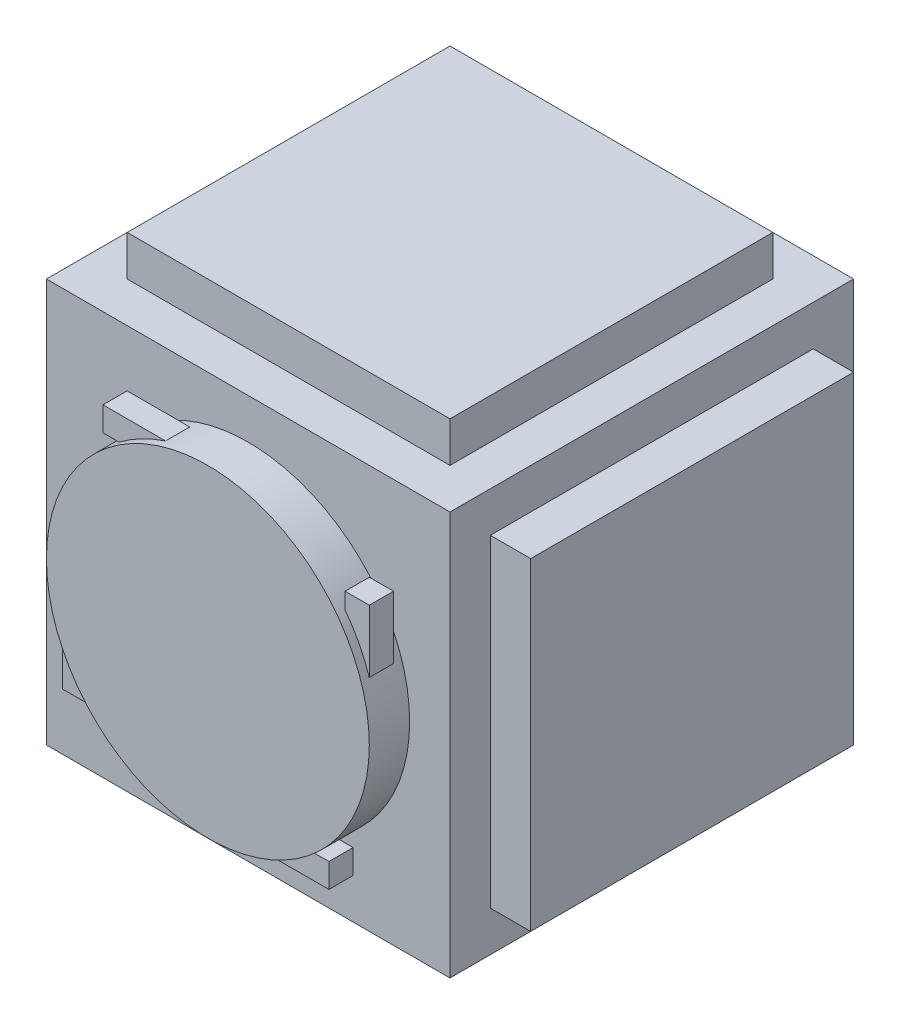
ISO-10303-21;
HEADER;
FILE_DESCRIPTION(('STEP AP214'),'2;1');
FILE_NAME('part.step','',(''),(''),'','','');
FILE_SCHEMA(('AUTOMOTIVE_DESIGN { 1 0 10303 214 1 1 1 1 }'));
ENDSEC;
DATA;
#1=APPLICATION_CONTEXT('core data for automotive mechanical design processes');
#2=APPLICATION_PROTOCOL_DEFINITION('international standard','automotive_design',2000,#1);
#3=PRODUCT_CONTEXT('',#1,'mechanical');
#4=PRODUCT('Part','Part','',(#3));
#5=PRODUCT_RELATED_PRODUCT_CATEGORY('part','',(#4));
#6=PRODUCT_DEFINITION_FORMATION('','',#4);
#7=PRODUCT_DEFINITION_CONTEXT('part definition',#1,'design');
#8=PRODUCT_DEFINITION('design','',#6,#7);
#9=PRODUCT_DEFINITION_SHAPE('','',#8);
#10=(LENGTH_UNIT() NAMED_UNIT(*) SI_UNIT(.MILLI.,.METRE.));
#11=(NAMED_UNIT(*) PLANE_ANGLE_UNIT() SI_UNIT($,.RADIAN.));
#12=(NAMED_UNIT(*) SI_UNIT($,.STERADIAN.) SOLID_ANGLE_UNIT());
#13=UNCERTAINTY_MEASURE_WITH_UNIT(LENGTH_MEASURE(1.E-05),#10,'distance_accuracy_value','');
#14=(GEOMETRIC_REPRESENTATION_CONTEXT(3) GLOBAL_UNCERTAINTY_ASSIGNED_CONTEXT((#13)) GLOBAL_UNIT_ASSIGNED_CONTEXT((#10,
#11,#12)) REPRESENTATION_CONTEXT('',''));
#15=CARTESIAN_POINT('',(0.,0.,0.));
#16=DIRECTION('',(0.,0.,1.));
#17=DIRECTION('',(1.,0.,0.));
#18=AXIS2_PLACEMENT_3D('',#15,#16,#17);
#19=CARTESIAN_POINT('',(125.,125.,190.210964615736));
#20=DIRECTION('',(0.,0.,-1.));
#21=DIRECTION('',(-1.,0.,0.));
#22=AXIS2_PLACEMENT_3D('',#19,#20,#21);
#23=CYLINDRICAL_SURFACE('',#22,50.);
#24=DIRECTION('',(0.,0.,-1.));
#25=VECTOR('',#24,1.);
#26=CARTESIAN_POINT('',(77.5,109.387505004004,190.210964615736));
#27=LINE('',#26,#25);
#28=CARTESIAN_POINT('',(77.5,109.387505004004,200.210964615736));
#29=VERTEX_POINT('',#28);
#30=CARTESIAN_POINT('',(77.5,109.387505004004,192.710964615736));
#31=VERTEX_POINT('',#30);
#32=EDGE_CURVE('E665',#29,#31,#27,.T.);
#33=ORIENTED_EDGE('',*,*,#32,.F.);
#34=CARTESIAN_POINT('',(125.,125.,200.210964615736));
#35=DIRECTION('',(0.,0.,-1.));
#36=DIRECTION('',(-1.,0.,0.));
#37=AXIS2_PLACEMENT_3D('',#34,#35,#36);
#38=CIRCLE('',#37,50.);
#39=CARTESIAN_POINT('',(85.,95.,200.210964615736));
#40=VERTEX_POINT('',#39);
#41=EDGE_CURVE('E653',#40,#29,#38,.T.);
#42=ORIENTED_EDGE('',*,*,#41,.F.);
#43=DIRECTION('',(0.,0.,-1.));
#44=VECTOR('',#43,1.);
#45=CARTESIAN_POINT('',(85.,95.,190.210964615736));
#46=LINE('',#45,#44);
#47=CARTESIAN_POINT('',(85.,95.,192.710964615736));
#48=VERTEX_POINT('',#47);
#49=EDGE_CURVE('E657',#48,#40,#46,.F.);
#50=ORIENTED_EDGE('',*,*,#49,.F.);
#51=CARTESIAN_POINT('',(125.,125.,192.710964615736));
#52=DIRECTION('',(0.,0.,1.));
#53=DIRECTION('',(1.,0.,0.));
#54=AXIS2_PLACEMENT_3D('',#51,#52,#53);
#55=CIRCLE('',#54,50.);
#56=EDGE_CURVE('E661',#31,#48,#55,.T.);
#57=ORIENTED_EDGE('',*,*,#56,.F.);
#58=EDGE_LOOP('',(#33,#42,#50,#57));
#59=FACE_BOUND('',#58,.T.);
#60=DIRECTION('',(0.,0.,-1.));
#61=VECTOR('',#60,1.);
#62=CARTESIAN_POINT('',(172.5,140.612494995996,190.210964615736));
#63=LINE('',#62,#61);
#64=CARTESIAN_POINT('',(172.5,140.612494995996,200.210964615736));
#65=VERTEX_POINT('',#64);
#66=CARTESIAN_POINT('',(172.5,140.612494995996,192.710964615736));
#67=VERTEX_POINT('',#66);
#68=EDGE_CURVE('E633',#65,#67,#63,.T.);
#69=ORIENTED_EDGE('',*,*,#68,.F.);
#70=CARTESIAN_POINT('',(125.,125.,200.210964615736));
#71=DIRECTION('',(0.,0.,-1.));
#72=DIRECTION('',(-1.,0.,0.));
#73=AXIS2_PLACEMENT_3D('',#70,#71,#72);
#74=CIRCLE('',#73,50.);
#75=CARTESIAN_POINT('',(165.,155.,200.210964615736));
#76=VERTEX_POINT('',#75);
#77=EDGE_CURVE('E621',#76,#65,#74,.T.);
#78=ORIENTED_EDGE('',*,*,#77,.F.);
#79=DIRECTION('',(0.,0.,-1.));
#80=VECTOR('',#79,1.);
#81=CARTESIAN_POINT('',(165.,155.,190.210964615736));
#82=LINE('',#81,#80);
#83=CARTESIAN_POINT('',(165.,155.,192.710964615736));
#84=VERTEX_POINT('',#83);
#85=EDGE_CURVE('E625',#84,#76,#82,.F.);
#86=ORIENTED_EDGE('',*,*,#85,.F.);
#87=CARTESIAN_POINT('',(125.,125.,192.710964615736));
#88=DIRECTION('',(0.,0.,1.));
#89=DIRECTION('',(1.,0.,0.));
#90=AXIS2_PLACEMENT_3D('',#87,#88,#89);
#91=CIRCLE('',#90,50.);
#92=EDGE_CURVE('E629',#67,#84,#91,.T.);
#93=ORIENTED_EDGE('',*,*,#92,.F.);
#94=EDGE_LOOP('',(#69,#78,#86,#93));
#95=FACE_BOUND('',#94,.T.);
#96=CARTESIAN_POINT('',(125.,125.,190.210964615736));
#97=DIRECTION('',(0.,0.,-1.));
#98=DIRECTION('',(-1.,0.,0.));
#99=AXIS2_PLACEMENT_3D('',#96,#97,#98);
#100=CIRCLE('',#99,50.);
#101=CARTESIAN_POINT('',(75.,125.,190.210964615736));
#102=VERTEX_POINT('',#101);
#103=EDGE_CURVE('E391',#102,#102,#100,.T.);
#104=ORIENTED_EDGE('',*,*,#103,.F.);
#105=EDGE_LOOP('',(#104));
#106=FACE_BOUND('',#105,.T.);
#107=CARTESIAN_POINT('',(125.,125.,202.710964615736));
#108=DIRECTION('',(0.,0.,-1.));
#109=DIRECTION('',(-1.,0.,0.));
#110=AXIS2_PLACEMENT_3D('',#107,#108,#109);
#111=CIRCLE('',#110,50.);
#112=CARTESIAN_POINT('',(75.,125.,202.710964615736));
#113=VERTEX_POINT('',#112);
#114=EDGE_CURVE('E395',#113,#113,#111,.T.);
#115=ORIENTED_EDGE('',*,*,#114,.T.);
#116=EDGE_LOOP('',(#115));
#117=FACE_BOUND('',#116,.T.);
#118=DIRECTION('',(0.,0.,-1.));
#119=VECTOR('',#118,1.);
#120=CARTESIAN_POINT('',(109.387505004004,172.5,190.210964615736));
#121=LINE('',#120,#119);
#122=CARTESIAN_POINT('',(109.387505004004,172.5,200.210964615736));
#123=VERTEX_POINT('',#122);
#124=CARTESIAN_POINT('',(109.387505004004,172.5,192.710964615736));
#125=VERTEX_POINT('',#124);
#126=EDGE_CURVE('E649',#123,#125,#121,.T.);
#127=ORIENTED_EDGE('',*,*,#126,.F.);
#128=CARTESIAN_POINT('',(125.,125.,200.210964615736));
#129=DIRECTION('',(0.,0.,-1.));
#130=DIRECTION('',(0.,1.,0.));
#131=AXIS2_PLACEMENT_3D('',#128,#129,#130);
#132=CIRCLE('',#131,50.);
#133=CARTESIAN_POINT('',(94.9999999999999,165.,200.210964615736));
#134=VERTEX_POINT('',#133);
#135=EDGE_CURVE('E637',#134,#123,#132,.T.);
#136=ORIENTED_EDGE('',*,*,#135,.F.);
#137=DIRECTION('',(0.,0.,-1.));
#138=VECTOR('',#137,1.);
#139=CARTESIAN_POINT('',(94.9999999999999,165.,190.210964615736));
#140=LINE('',#139,#138);
#141=CARTESIAN_POINT('',(94.9999999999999,165.,192.710964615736));
#142=VERTEX_POINT('',#141);
#143=EDGE_CURVE('E641',#142,#134,#140,.F.);
#144=ORIENTED_EDGE('',*,*,#143,.F.);
#145=CARTESIAN_POINT('',(125.,125.,192.710964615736));
#146=DIRECTION('',(0.,0.,1.));
#147=DIRECTION('',(1.,0.,0.));
#148=AXIS2_PLACEMENT_3D('',#145,#146,#147);
#149=CIRCLE('',#148,50.);
#150=EDGE_CURVE('E645',#125,#142,#149,.T.);
#151=ORIENTED_EDGE('',*,*,#150,.F.);
#152=EDGE_LOOP('',(#127,#136,#144,#151));
#153=FACE_BOUND('',#152,.T.);
#154=DIRECTION('',(0.,0.,-1.));
#155=VECTOR('',#154,1.);
#156=CARTESIAN_POINT('',(140.612494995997,77.5000000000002,190.210964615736));
#157=LINE('',#156,#155);
#158=CARTESIAN_POINT('',(140.612494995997,77.5000000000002,200.210964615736));
#159=VERTEX_POINT('',#158);
#160=CARTESIAN_POINT('',(140.612494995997,77.5000000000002,192.710964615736));
#161=VERTEX_POINT('',#160);
#162=EDGE_CURVE('E11',#159,#161,#157,.T.);
#163=ORIENTED_EDGE('',*,*,#162,.F.);
#164=CARTESIAN_POINT('',(125.,125.,200.210964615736));
#165=DIRECTION('',(0.,0.,-1.));
#166=DIRECTION('',(0.,1.,0.));
#167=AXIS2_PLACEMENT_3D('',#164,#165,#166);
#168=CIRCLE('',#167,50.);
#169=CARTESIAN_POINT('',(155.,85.0000000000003,200.210964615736));
#170=VERTEX_POINT('',#169);
#171=EDGE_CURVE('E669',#170,#159,#168,.T.);
#172=ORIENTED_EDGE('',*,*,#171,.F.);
#173=DIRECTION('',(0.,0.,-1.));
#174=VECTOR('',#173,1.);
#175=CARTESIAN_POINT('',(155.,85.0000000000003,190.210964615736));
#176=LINE('',#175,#174);
#177=CARTESIAN_POINT('',(155.,85.0000000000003,192.710964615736));
#178=VERTEX_POINT('',#177);
#179=EDGE_CURVE('E63',#178,#170,#176,.F.);
#180=ORIENTED_EDGE('',*,*,#179,.F.);
#181=CARTESIAN_POINT('',(125.,125.,192.710964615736));
#182=DIRECTION('',(0.,0.,1.));
#183=DIRECTION('',(1.,0.,0.));
#184=AXIS2_PLACEMENT_3D('',#181,#182,#183);
#185=CIRCLE('',#184,50.);
#186=EDGE_CURVE('E53',#161,#178,#185,.T.);
#187=ORIENTED_EDGE('',*,*,#186,.F.);
#188=EDGE_LOOP('',(#163,#172,#180,#187));
#189=FACE_BOUND('',#188,.T.);
#190=ADVANCED_FACE('F44',(#59,#95,#106,#117,#153,#189),#23,.T.);
#191=CARTESIAN_POINT('',(187.5,62.5,190.210964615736));
#192=DIRECTION('',(-1.,0.,0.));
#193=DIRECTION('',(0.,0.,1.));
#194=AXIS2_PLACEMENT_3D('',#191,#192,#193);
#195=PLANE('',#194);
#196=DIRECTION('',(0.,1.,0.));
#197=VECTOR('',#196,1.);
#198=CARTESIAN_POINT('',(187.5,62.5,65.2109646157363));
#199=LINE('',#198,#197);
#200=CARTESIAN_POINT('',(187.5,62.5,65.2109646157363));
#201=VERTEX_POINT('',#200);
#202=CARTESIAN_POINT('',(187.5,187.5,65.2109646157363));
#203=VERTEX_POINT('',#202);
#204=EDGE_CURVE('E601',#201,#203,#199,.T.);
#205=ORIENTED_EDGE('',*,*,#204,.T.);
#206=DIRECTION('',(0.,0.,-1.));
#207=VECTOR('',#206,1.);
#208=CARTESIAN_POINT('',(187.5,187.5,190.210964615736));
#209=LINE('',#208,#207);
#210=CARTESIAN_POINT('',(187.5,187.5,190.210964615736));
#211=VERTEX_POINT('',#210);
#212=EDGE_CURVE('E609',#211,#203,#209,.T.);
#213=ORIENTED_EDGE('',*,*,#212,.F.);
#214=DIRECTION('',(0.,1.,0.));
#215=VECTOR('',#214,1.);
#216=CARTESIAN_POINT('',(187.5,62.5,190.210964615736));
#217=LINE('',#216,#215);
#218=CARTESIAN_POINT('',(187.5,62.5,190.210964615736));
#219=VERTEX_POINT('',#218);
#220=EDGE_CURVE('E588',#219,#211,#217,.T.);
#221=ORIENTED_EDGE('',*,*,#220,.F.);
#222=DIRECTION('',(0.,0.,-1.));
#223=VECTOR('',#222,1.);
#224=CARTESIAN_POINT('',(187.5,62.5,190.210964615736));
#225=LINE('',#224,#223);
#226=EDGE_CURVE('E613',#219,#201,#225,.T.);
#227=ORIENTED_EDGE('',*,*,#226,.T.);
#228=EDGE_LOOP('',(#205,#213,#221,#227));
#229=FACE_BOUND('',#228,.T.);
#230=DIRECTION('',(0.,0.,1.));
#231=VECTOR('',#230,1.);
#232=CARTESIAN_POINT('',(187.499999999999,175.000000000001,177.710964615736));
#233=LINE('',#232,#231);
#234=CARTESIAN_POINT('',(187.499999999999,175.000000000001,77.7109646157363));
#235=VERTEX_POINT('',#234);
#236=CARTESIAN_POINT('',(187.499999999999,175.000000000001,177.710964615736));
#237=VERTEX_POINT('',#236);
#238=EDGE_CURVE('E399',#235,#237,#233,.T.);
#239=ORIENTED_EDGE('',*,*,#238,.F.);
#240=DIRECTION('',(0.,1.,0.));
#241=VECTOR('',#240,1.);
#242=CARTESIAN_POINT('',(187.499999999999,175.000000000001,77.7109646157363));
#243=LINE('',#242,#241);
#244=CARTESIAN_POINT('',(187.500000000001,75.0000000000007,77.7109646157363));
#245=VERTEX_POINT('',#244);
#246=EDGE_CURVE('E405',#245,#235,#243,.T.);
#247=ORIENTED_EDGE('',*,*,#246,.F.);
#248=DIRECTION('',(0.,0.,-1.));
#249=VECTOR('',#248,1.);
#250=CARTESIAN_POINT('',(187.500000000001,75.0000000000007,177.710964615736));
#251=LINE('',#250,#249);
#252=CARTESIAN_POINT('',(187.500000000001,75.0000000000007,177.710964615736));
#253=VERTEX_POINT('',#252);
#254=EDGE_CURVE('E422',#253,#245,#251,.T.);
#255=ORIENTED_EDGE('',*,*,#254,.F.);
#256=DIRECTION('',(0.,-1.,0.));
#257=VECTOR('',#256,1.);
#258=CARTESIAN_POINT('',(187.499999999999,175.000000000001,177.710964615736));
#259=LINE('',#258,#257);
#260=EDGE_CURVE('E418',#237,#253,#259,.T.);
#261=ORIENTED_EDGE('',*,*,#260,.F.);
#262=EDGE_LOOP('',(#239,#247,#255,#261));
#263=FACE_BOUND('',#262,.T.);
#264=ADVANCED_FACE('F690',(#229,#263),#195,.F.);
#265=CARTESIAN_POINT('',(62.5,62.5,190.210964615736));
#266=DIRECTION('',(0.,1.,0.));
#267=DIRECTION('',(0.,0.,1.));
#268=AXIS2_PLACEMENT_3D('',#265,#266,#267);
#269=PLANE('',#268);
#270=DIRECTION('',(1.,0.,0.));
#271=VECTOR('',#270,1.);
#272=CARTESIAN_POINT('',(62.5,62.5,65.2109646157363));
#273=LINE('',#272,#271);
#274=CARTESIAN_POINT('',(62.5,62.5,65.2109646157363));
#275=VERTEX_POINT('',#274);
#276=EDGE_CURVE('E598',#275,#201,#273,.T.);
#277=ORIENTED_EDGE('',*,*,#276,.T.);
#278=ORIENTED_EDGE('',*,*,#226,.F.);
#279=DIRECTION('',(1.,0.,0.));
#280=VECTOR('',#279,1.);
#281=CARTESIAN_POINT('',(62.5,62.5,190.210964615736));
#282=LINE('',#281,#280);
#283=CARTESIAN_POINT('',(62.5,62.5,190.210964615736));
#284=VERTEX_POINT('',#283);
#285=EDGE_CURVE('E584',#284,#219,#282,.T.);
#286=ORIENTED_EDGE('',*,*,#285,.F.);
#287=DIRECTION('',(0.,0.,-1.));
#288=VECTOR('',#287,1.);
#289=CARTESIAN_POINT('',(62.5,62.5,190.210964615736));
#290=LINE('',#289,#288);
#291=EDGE_CURVE('E617',#284,#275,#290,.T.);
#292=ORIENTED_EDGE('',*,*,#291,.T.);
#293=EDGE_LOOP('',(#277,#278,#286,#292));
#294=FACE_BOUND('',#293,.T.);
#295=DIRECTION('',(0.,0.,1.));
#296=VECTOR('',#295,1.);
#297=CARTESIAN_POINT('',(175.,62.5,177.710964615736));
#298=LINE('',#297,#296);
#299=CARTESIAN_POINT('',(175.,62.5,77.7109646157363));
#300=VERTEX_POINT('',#299);
#301=CARTESIAN_POINT('',(175.,62.5,177.710964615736));
#302=VERTEX_POINT('',#301);
#303=EDGE_CURVE('E444',#300,#302,#298,.T.);
#304=ORIENTED_EDGE('',*,*,#303,.F.);
#305=DIRECTION('',(1.,0.,0.));
#306=VECTOR('',#305,1.);
#307=CARTESIAN_POINT('',(175.,62.5,77.7109646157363));
#308=LINE('',#307,#306);
#309=CARTESIAN_POINT('',(75.,62.5,77.7109646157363));
#310=VERTEX_POINT('',#309);
#311=EDGE_CURVE('E450',#310,#300,#308,.T.);
#312=ORIENTED_EDGE('',*,*,#311,.F.);
#313=DIRECTION('',(0.,0.,-1.));
#314=VECTOR('',#313,1.);
#315=CARTESIAN_POINT('',(75.,62.5,177.710964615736));
#316=LINE('',#315,#314);
#317=CARTESIAN_POINT('',(75.,62.5,177.710964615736));
#318=VERTEX_POINT('',#317);
#319=EDGE_CURVE('E467',#318,#310,#316,.T.);
#320=ORIENTED_EDGE('',*,*,#319,.F.);
#321=DIRECTION('',(-1.,0.,0.));
#322=VECTOR('',#321,1.);
#323=CARTESIAN_POINT('',(175.,62.5,177.710964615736));
#324=LINE('',#323,#322);
#325=EDGE_CURVE('E463',#302,#318,#324,.T.);
#326=ORIENTED_EDGE('',*,*,#325,.F.);
#327=EDGE_LOOP('',(#304,#312,#320,#326));
#328=FACE_BOUND('',#327,.T.);
#329=ADVANCED_FACE('F696',(#294,#328),#269,.F.);
#330=CARTESIAN_POINT('',(62.5,62.5,190.210964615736));
#331=DIRECTION('',(1.,0.,0.));
#332=DIRECTION('',(0.,0.,-1.));
#333=AXIS2_PLACEMENT_3D('',#330,#331,#332);
#334=PLANE('',#333);
#335=DIRECTION('',(0.,-1.,0.));
#336=VECTOR('',#335,1.);
#337=CARTESIAN_POINT('',(62.5,62.5,65.2109646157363));
#338=LINE('',#337,#336);
#339=CARTESIAN_POINT('',(62.5,187.5,65.2109646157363));
#340=VERTEX_POINT('',#339);
#341=EDGE_CURVE('E579',#340,#275,#338,.T.);
#342=ORIENTED_EDGE('',*,*,#341,.T.);
#343=ORIENTED_EDGE('',*,*,#291,.F.);
#344=DIRECTION('',(0.,-1.,0.));
#345=VECTOR('',#344,1.);
#346=CARTESIAN_POINT('',(62.5,62.5,190.210964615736));
#347=LINE('',#346,#345);
#348=CARTESIAN_POINT('',(62.5,187.5,190.210964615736));
#349=VERTEX_POINT('',#348);
#350=EDGE_CURVE('E580',#349,#284,#347,.T.);
#351=ORIENTED_EDGE('',*,*,#350,.F.);
#352=DIRECTION('',(0.,0.,-1.));
#353=VECTOR('',#352,1.);
#354=CARTESIAN_POINT('',(62.5,187.5,190.210964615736));
#355=LINE('',#354,#353);
#356=EDGE_CURVE('E594',#349,#340,#355,.T.);
#357=ORIENTED_EDGE('',*,*,#356,.T.);
#358=EDGE_LOOP('',(#342,#343,#351,#357));
#359=FACE_BOUND('',#358,.T.);
#360=DIRECTION('',(0.,0.,1.));
#361=VECTOR('',#360,1.);
#362=CARTESIAN_POINT('',(62.5000000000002,74.9999999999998,177.710964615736));
#363=LINE('',#362,#361);
#364=CARTESIAN_POINT('',(62.5000000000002,74.9999999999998,77.7109646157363));
#365=VERTEX_POINT('',#364);
#366=CARTESIAN_POINT('',(62.5000000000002,74.9999999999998,177.710964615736));
#367=VERTEX_POINT('',#366);
#368=EDGE_CURVE('E489',#365,#367,#363,.T.);
#369=ORIENTED_EDGE('',*,*,#368,.F.);
#370=DIRECTION('',(0.,-1.,0.));
#371=VECTOR('',#370,1.);
#372=CARTESIAN_POINT('',(62.5000000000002,74.9999999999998,77.7109646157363));
#373=LINE('',#372,#371);
#374=CARTESIAN_POINT('',(62.4999999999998,175.,77.7109646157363));
#375=VERTEX_POINT('',#374);
#376=EDGE_CURVE('E495',#375,#365,#373,.T.);
#377=ORIENTED_EDGE('',*,*,#376,.F.);
#378=DIRECTION('',(0.,0.,-1.));
#379=VECTOR('',#378,1.);
#380=CARTESIAN_POINT('',(62.4999999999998,175.,177.710964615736));
#381=LINE('',#380,#379);
#382=CARTESIAN_POINT('',(62.4999999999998,175.,177.710964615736));
#383=VERTEX_POINT('',#382);
#384=EDGE_CURVE('E512',#383,#375,#381,.T.);
#385=ORIENTED_EDGE('',*,*,#384,.F.);
#386=DIRECTION('',(0.,1.,0.));
#387=VECTOR('',#386,1.);
#388=CARTESIAN_POINT('',(62.5000000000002,74.9999999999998,177.710964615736));
#389=LINE('',#388,#387);
#390=EDGE_CURVE('E508',#367,#383,#389,.T.);
#391=ORIENTED_EDGE('',*,*,#390,.F.);
#392=EDGE_LOOP('',(#369,#377,#385,#391));
#393=FACE_BOUND('',#392,.T.);
#394=ADVANCED_FACE('F46',(#359,#393),#334,.F.);
#395=CARTESIAN_POINT('',(62.5,187.5,190.210964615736));
#396=DIRECTION('',(0.,-1.,0.));
#397=DIRECTION('',(0.,0.,-1.));
#398=AXIS2_PLACEMENT_3D('',#395,#396,#397);
#399=PLANE('',#398);
#400=DIRECTION('',(-1.,0.,0.));
#401=VECTOR('',#400,1.);
#402=CARTESIAN_POINT('',(62.5,187.5,65.2109646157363));
#403=LINE('',#402,#401);
#404=EDGE_CURVE('E585',#203,#340,#403,.T.);
#405=ORIENTED_EDGE('',*,*,#404,.T.);
#406=ORIENTED_EDGE('',*,*,#356,.F.);
#407=DIRECTION('',(-1.,0.,0.));
#408=VECTOR('',#407,1.);
#409=CARTESIAN_POINT('',(62.5,187.5,190.210964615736));
#410=LINE('',#409,#408);
#411=EDGE_CURVE('E591',#211,#349,#410,.T.);
#412=ORIENTED_EDGE('',*,*,#411,.F.);
#413=ORIENTED_EDGE('',*,*,#212,.T.);
#414=EDGE_LOOP('',(#405,#406,#412,#413));
#415=FACE_BOUND('',#414,.T.);
#416=DIRECTION('',(0.,0.,1.));
#417=VECTOR('',#416,1.);
#418=CARTESIAN_POINT('',(75.,187.5,177.710964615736));
#419=LINE('',#418,#417);
#420=CARTESIAN_POINT('',(75.,187.5,77.7109646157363));
#421=VERTEX_POINT('',#420);
#422=CARTESIAN_POINT('',(75.,187.5,177.710964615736));
#423=VERTEX_POINT('',#422);
#424=EDGE_CURVE('E534',#421,#423,#419,.T.);
#425=ORIENTED_EDGE('',*,*,#424,.F.);
#426=DIRECTION('',(-1.,0.,0.));
#427=VECTOR('',#426,1.);
#428=CARTESIAN_POINT('',(75.,187.5,77.7109646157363));
#429=LINE('',#428,#427);
#430=CARTESIAN_POINT('',(175.,187.5,77.7109646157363));
#431=VERTEX_POINT('',#430);
#432=EDGE_CURVE('E540',#431,#421,#429,.T.);
#433=ORIENTED_EDGE('',*,*,#432,.F.);
#434=DIRECTION('',(0.,0.,-1.));
#435=VECTOR('',#434,1.);
#436=CARTESIAN_POINT('',(175.,187.5,177.710964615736));
#437=LINE('',#436,#435);
#438=CARTESIAN_POINT('',(175.,187.5,177.710964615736));
#439=VERTEX_POINT('',#438);
#440=EDGE_CURVE('E557',#439,#431,#437,.T.);
#441=ORIENTED_EDGE('',*,*,#440,.F.);
#442=DIRECTION('',(1.,0.,0.));
#443=VECTOR('',#442,1.);
#444=CARTESIAN_POINT('',(75.,187.5,177.710964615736));
#445=LINE('',#444,#443);
#446=EDGE_CURVE('E553',#423,#439,#445,.T.);
#447=ORIENTED_EDGE('',*,*,#446,.F.);
#448=EDGE_LOOP('',(#425,#433,#441,#447));
#449=FACE_BOUND('',#448,.T.);
#450=ADVANCED_FACE('F792',(#415,#449),#399,.F.);
#451=CARTESIAN_POINT('',(62.5,62.5,190.210964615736));
#452=DIRECTION('',(0.,0.,-1.));
#453=DIRECTION('',(-1.,0.,0.));
#454=AXIS2_PLACEMENT_3D('',#451,#452,#453);
#455=PLANE('',#454);
#456=ORIENTED_EDGE('',*,*,#103,.T.);
#457=EDGE_LOOP('',(#456));
#458=FACE_BOUND('',#457,.T.);
#459=ORIENTED_EDGE('',*,*,#350,.T.);
#460=ORIENTED_EDGE('',*,*,#285,.T.);
#461=ORIENTED_EDGE('',*,*,#220,.T.);
#462=ORIENTED_EDGE('',*,*,#411,.T.);
#463=EDGE_LOOP('',(#459,#460,#461,#462));
#464=FACE_BOUND('',#463,.T.);
#465=ADVANCED_FACE('F789',(#458,#464),#455,.F.);
#466=CARTESIAN_POINT('',(62.5,62.5,65.2109646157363));
#467=DIRECTION('',(0.,0.,-1.));
#468=DIRECTION('',(-1.,0.,0.));
#469=AXIS2_PLACEMENT_3D('',#466,#467,#468);
#470=PLANE('',#469);
#471=ORIENTED_EDGE('',*,*,#341,.F.);
#472=ORIENTED_EDGE('',*,*,#404,.F.);
#473=ORIENTED_EDGE('',*,*,#204,.F.);
#474=ORIENTED_EDGE('',*,*,#276,.F.);
#475=EDGE_LOOP('',(#471,#472,#473,#474));
#476=FACE_BOUND('',#475,.T.);
#477=ADVANCED_FACE('F787',(#476),#470,.T.);
#478=CARTESIAN_POINT('',(75.,200.,177.710964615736));
#479=DIRECTION('',(1.,0.,0.));
#480=DIRECTION('',(0.,0.,-1.));
#481=AXIS2_PLACEMENT_3D('',#478,#479,#480);
#482=PLANE('',#481);
#483=ORIENTED_EDGE('',*,*,#424,.T.);
#484=DIRECTION('',(0.,-1.,0.));
#485=VECTOR('',#484,1.);
#486=CARTESIAN_POINT('',(75.,200.,177.710964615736));
#487=LINE('',#486,#485);
#488=CARTESIAN_POINT('',(75.,200.,177.710964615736));
#489=VERTEX_POINT('',#488);
#490=EDGE_CURVE('E575',#489,#423,#487,.T.);
#491=ORIENTED_EDGE('',*,*,#490,.F.);
#492=DIRECTION('',(0.,0.,1.));
#493=VECTOR('',#492,1.);
#494=CARTESIAN_POINT('',(75.,200.,177.710964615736));
#495=LINE('',#494,#493);
#496=CARTESIAN_POINT('',(75.,200.,77.7109646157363));
#497=VERTEX_POINT('',#496);
#498=EDGE_CURVE('E535',#497,#489,#495,.T.);
#499=ORIENTED_EDGE('',*,*,#498,.F.);
#500=DIRECTION('',(0.,-1.,0.));
#501=VECTOR('',#500,1.);
#502=CARTESIAN_POINT('',(75.,200.,77.7109646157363));
#503=LINE('',#502,#501);
#504=EDGE_CURVE('E549',#497,#421,#503,.T.);
#505=ORIENTED_EDGE('',*,*,#504,.T.);
#506=EDGE_LOOP('',(#483,#491,#499,#505));
#507=FACE_BOUND('',#506,.T.);
#508=ADVANCED_FACE('F783',(#507),#482,.F.);
#509=CARTESIAN_POINT('',(75.,200.,177.710964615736));
#510=DIRECTION('',(0.,0.,-1.));
#511=DIRECTION('',(-1.,0.,0.));
#512=AXIS2_PLACEMENT_3D('',#509,#510,#511);
#513=PLANE('',#512);
#514=ORIENTED_EDGE('',*,*,#446,.T.);
#515=DIRECTION('',(0.,-1.,0.));
#516=VECTOR('',#515,1.);
#517=CARTESIAN_POINT('',(175.,200.,177.710964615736));
#518=LINE('',#517,#516);
#519=CARTESIAN_POINT('',(175.,200.,177.710964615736));
#520=VERTEX_POINT('',#519);
#521=EDGE_CURVE('E571',#520,#439,#518,.T.);
#522=ORIENTED_EDGE('',*,*,#521,.F.);
#523=DIRECTION('',(1.,0.,0.));
#524=VECTOR('',#523,1.);
#525=CARTESIAN_POINT('',(75.,200.,177.710964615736));
#526=LINE('',#525,#524);
#527=EDGE_CURVE('E539',#489,#520,#526,.T.);
#528=ORIENTED_EDGE('',*,*,#527,.F.);
#529=ORIENTED_EDGE('',*,*,#490,.T.);
#530=EDGE_LOOP('',(#514,#522,#528,#529));
#531=FACE_BOUND('',#530,.T.);
#532=ADVANCED_FACE('F779',(#531),#513,.F.);
#533=CARTESIAN_POINT('',(175.,200.,177.710964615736));
#534=DIRECTION('',(-1.,0.,0.));
#535=DIRECTION('',(0.,0.,1.));
#536=AXIS2_PLACEMENT_3D('',#533,#534,#535);
#537=PLANE('',#536);
#538=ORIENTED_EDGE('',*,*,#440,.T.);
#539=DIRECTION('',(0.,-1.,0.));
#540=VECTOR('',#539,1.);
#541=CARTESIAN_POINT('',(175.,200.,77.7109646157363));
#542=LINE('',#541,#540);
#543=CARTESIAN_POINT('',(175.,200.,77.7109646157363));
#544=VERTEX_POINT('',#543);
#545=EDGE_CURVE('E567',#544,#431,#542,.T.);
#546=ORIENTED_EDGE('',*,*,#545,.F.);
#547=DIRECTION('',(0.,0.,-1.));
#548=VECTOR('',#547,1.);
#549=CARTESIAN_POINT('',(175.,200.,177.710964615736));
#550=LINE('',#549,#548);
#551=EDGE_CURVE('E543',#520,#544,#550,.T.);
#552=ORIENTED_EDGE('',*,*,#551,.F.);
#553=ORIENTED_EDGE('',*,*,#521,.T.);
#554=EDGE_LOOP('',(#538,#546,#552,#553));
#555=FACE_BOUND('',#554,.T.);
#556=ADVANCED_FACE('F775',(#555),#537,.F.);
#557=CARTESIAN_POINT('',(75.,200.,77.7109646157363));
#558=DIRECTION('',(0.,0.,1.));
#559=DIRECTION('',(1.,0.,0.));
#560=AXIS2_PLACEMENT_3D('',#557,#558,#559);
#561=PLANE('',#560);
#562=ORIENTED_EDGE('',*,*,#432,.T.);
#563=ORIENTED_EDGE('',*,*,#504,.F.);
#564=DIRECTION('',(-1.,0.,0.));
#565=VECTOR('',#564,1.);
#566=CARTESIAN_POINT('',(75.,200.,77.7109646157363));
#567=LINE('',#566,#565);
#568=EDGE_CURVE('E546',#544,#497,#567,.T.);
#569=ORIENTED_EDGE('',*,*,#568,.F.);
#570=ORIENTED_EDGE('',*,*,#545,.T.);
#571=EDGE_LOOP('',(#562,#563,#569,#570));
#572=FACE_BOUND('',#571,.T.);
#573=ADVANCED_FACE('F771',(#572),#561,.F.);
#574=CARTESIAN_POINT('',(62.5,200.,65.2109646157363));
#575=DIRECTION('',(0.,-1.,0.));
#576=DIRECTION('',(0.,0.,-1.));
#577=AXIS2_PLACEMENT_3D('',#574,#575,#576);
#578=PLANE('',#577);
#579=ORIENTED_EDGE('',*,*,#498,.T.);
#580=ORIENTED_EDGE('',*,*,#527,.T.);
#581=ORIENTED_EDGE('',*,*,#551,.T.);
#582=ORIENTED_EDGE('',*,*,#568,.T.);
#583=EDGE_LOOP('',(#579,#580,#581,#582));
#584=FACE_BOUND('',#583,.T.);
#585=ADVANCED_FACE('F767',(#584),#578,.F.);
#586=CARTESIAN_POINT('',(50.0000000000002,74.9999999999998,177.710964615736));
#587=DIRECTION('',(0.,1.,0.));
#588=DIRECTION('',(-1.,0.,0.));
#589=AXIS2_PLACEMENT_3D('',#586,#587,#588);
#590=PLANE('',#589);
#591=ORIENTED_EDGE('',*,*,#368,.T.);
#592=DIRECTION('',(1.,0.,0.));
#593=VECTOR('',#592,1.);
#594=CARTESIAN_POINT('',(50.0000000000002,74.9999999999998,177.710964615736));
#595=LINE('',#594,#593);
#596=CARTESIAN_POINT('',(50.0000000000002,74.9999999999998,177.710964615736));
#597=VERTEX_POINT('',#596);
#598=EDGE_CURVE('E530',#597,#367,#595,.T.);
#599=ORIENTED_EDGE('',*,*,#598,.F.);
#600=DIRECTION('',(0.,0.,1.));
#601=VECTOR('',#600,1.);
#602=CARTESIAN_POINT('',(50.0000000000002,74.9999999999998,177.710964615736));
#603=LINE('',#602,#601);
#604=CARTESIAN_POINT('',(50.0000000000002,74.9999999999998,77.7109646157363));
#605=VERTEX_POINT('',#604);
#606=EDGE_CURVE('E490',#605,#597,#603,.T.);
#607=ORIENTED_EDGE('',*,*,#606,.F.);
#608=DIRECTION('',(1.,0.,0.));
#609=VECTOR('',#608,1.);
#610=CARTESIAN_POINT('',(50.0000000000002,74.9999999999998,77.7109646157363));
#611=LINE('',#610,#609);
#612=EDGE_CURVE('E504',#605,#365,#611,.T.);
#613=ORIENTED_EDGE('',*,*,#612,.T.);
#614=EDGE_LOOP('',(#591,#599,#607,#613));
#615=FACE_BOUND('',#614,.T.);
#616=ADVANCED_FACE('F763',(#615),#590,.F.);
#617=CARTESIAN_POINT('',(50.0000000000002,74.9999999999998,177.710964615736));
#618=DIRECTION('',(0.,0.,-1.));
#619=DIRECTION('',(-1.,0.,0.));
#620=AXIS2_PLACEMENT_3D('',#617,#618,#619);
#621=PLANE('',#620);
#622=ORIENTED_EDGE('',*,*,#390,.T.);
#623=DIRECTION('',(1.,0.,0.));
#624=VECTOR('',#623,1.);
#625=CARTESIAN_POINT('',(49.9999999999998,175.,177.710964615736));
#626=LINE('',#625,#624);
#627=CARTESIAN_POINT('',(49.9999999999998,175.,177.710964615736));
#628=VERTEX_POINT('',#627);
#629=EDGE_CURVE('E526',#628,#383,#626,.T.);
#630=ORIENTED_EDGE('',*,*,#629,.F.);
#631=DIRECTION('',(0.,1.,0.));
#632=VECTOR('',#631,1.);
#633=CARTESIAN_POINT('',(50.0000000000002,74.9999999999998,177.710964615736));
#634=LINE('',#633,#632);
#635=EDGE_CURVE('E494',#597,#628,#634,.T.);
#636=ORIENTED_EDGE('',*,*,#635,.F.);
#637=ORIENTED_EDGE('',*,*,#598,.T.);
#638=EDGE_LOOP('',(#622,#630,#636,#637));
#639=FACE_BOUND('',#638,.T.);
#640=ADVANCED_FACE('F759',(#639),#621,.F.);
#641=CARTESIAN_POINT('',(49.9999999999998,175.,177.710964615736));
#642=DIRECTION('',(0.,-1.,0.));
#643=DIRECTION('',(1.,0.,0.));
#644=AXIS2_PLACEMENT_3D('',#641,#642,#643);
#645=PLANE('',#644);
#646=ORIENTED_EDGE('',*,*,#384,.T.);
#647=DIRECTION('',(1.,0.,0.));
#648=VECTOR('',#647,1.);
#649=CARTESIAN_POINT('',(49.9999999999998,175.,77.7109646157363));
#650=LINE('',#649,#648);
#651=CARTESIAN_POINT('',(49.9999999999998,175.,77.7109646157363));
#652=VERTEX_POINT('',#651);
#653=EDGE_CURVE('E522',#652,#375,#650,.T.);
#654=ORIENTED_EDGE('',*,*,#653,.F.);
#655=DIRECTION('',(0.,0.,-1.));
#656=VECTOR('',#655,1.);
#657=CARTESIAN_POINT('',(49.9999999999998,175.,177.710964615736));
#658=LINE('',#657,#656);
#659=EDGE_CURVE('E498',#628,#652,#658,.T.);
#660=ORIENTED_EDGE('',*,*,#659,.F.);
#661=ORIENTED_EDGE('',*,*,#629,.T.);
#662=EDGE_LOOP('',(#646,#654,#660,#661));
#663=FACE_BOUND('',#662,.T.);
#664=ADVANCED_FACE('F755',(#663),#645,.F.);
#665=CARTESIAN_POINT('',(50.0000000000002,74.9999999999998,77.7109646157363));
#666=DIRECTION('',(0.,0.,1.));
#667=DIRECTION('',(1.,0.,0.));
#668=AXIS2_PLACEMENT_3D('',#665,#666,#667);
#669=PLANE('',#668);
#670=ORIENTED_EDGE('',*,*,#376,.T.);
#671=ORIENTED_EDGE('',*,*,#612,.F.);
#672=DIRECTION('',(0.,-1.,0.));
#673=VECTOR('',#672,1.);
#674=CARTESIAN_POINT('',(50.0000000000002,74.9999999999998,77.7109646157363));
#675=LINE('',#674,#673);
#676=EDGE_CURVE('E501',#652,#605,#675,.T.);
#677=ORIENTED_EDGE('',*,*,#676,.F.);
#678=ORIENTED_EDGE('',*,*,#653,.T.);
#679=EDGE_LOOP('',(#670,#671,#677,#678));
#680=FACE_BOUND('',#679,.T.);
#681=ADVANCED_FACE('F751',(#680),#669,.F.);
#682=CARTESIAN_POINT('',(50.0000000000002,62.4999999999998,65.2109646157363));
#683=DIRECTION('',(1.,0.,0.));
#684=DIRECTION('',(0.,0.,-1.));
#685=AXIS2_PLACEMENT_3D('',#682,#683,#684);
#686=PLANE('',#685);
#687=ORIENTED_EDGE('',*,*,#606,.T.);
#688=ORIENTED_EDGE('',*,*,#635,.T.);
#689=ORIENTED_EDGE('',*,*,#659,.T.);
#690=ORIENTED_EDGE('',*,*,#676,.T.);
#691=EDGE_LOOP('',(#687,#688,#689,#690));
#692=FACE_BOUND('',#691,.T.);
#693=ADVANCED_FACE('F747',(#692),#686,.F.);
#694=CARTESIAN_POINT('',(175.,50.,177.710964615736));
#695=DIRECTION('',(-1.,0.,0.));
#696=DIRECTION('',(0.,0.,1.));
#697=AXIS2_PLACEMENT_3D('',#694,#695,#696);
#698=PLANE('',#697);
#699=ORIENTED_EDGE('',*,*,#303,.T.);
#700=DIRECTION('',(0.,1.,0.));
#701=VECTOR('',#700,1.);
#702=CARTESIAN_POINT('',(175.,50.,177.710964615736));
#703=LINE('',#702,#701);
#704=CARTESIAN_POINT('',(175.,50.,177.710964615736));
#705=VERTEX_POINT('',#704);
#706=EDGE_CURVE('E485',#705,#302,#703,.T.);
#707=ORIENTED_EDGE('',*,*,#706,.F.);
#708=DIRECTION('',(0.,0.,1.));
#709=VECTOR('',#708,1.);
#710=CARTESIAN_POINT('',(175.,50.,177.710964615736));
#711=LINE('',#710,#709);
#712=CARTESIAN_POINT('',(175.,50.,77.7109646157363));
#713=VERTEX_POINT('',#712);
#714=EDGE_CURVE('E445',#713,#705,#711,.T.);
#715=ORIENTED_EDGE('',*,*,#714,.F.);
#716=DIRECTION('',(0.,1.,0.));
#717=VECTOR('',#716,1.);
#718=CARTESIAN_POINT('',(175.,50.,77.7109646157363));
#719=LINE('',#718,#717);
#720=EDGE_CURVE('E459',#713,#300,#719,.T.);
#721=ORIENTED_EDGE('',*,*,#720,.T.);
#722=EDGE_LOOP('',(#699,#707,#715,#721));
#723=FACE_BOUND('',#722,.T.);
#724=ADVANCED_FACE('F743',(#723),#698,.F.);
#725=CARTESIAN_POINT('',(175.,50.,177.710964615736));
#726=DIRECTION('',(0.,0.,-1.));
#727=DIRECTION('',(-1.,0.,0.));
#728=AXIS2_PLACEMENT_3D('',#725,#726,#727);
#729=PLANE('',#728);
#730=ORIENTED_EDGE('',*,*,#325,.T.);
#731=DIRECTION('',(0.,1.,0.));
#732=VECTOR('',#731,1.);
#733=CARTESIAN_POINT('',(75.,50.,177.710964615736));
#734=LINE('',#733,#732);
#735=CARTESIAN_POINT('',(75.,50.,177.710964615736));
#736=VERTEX_POINT('',#735);
#737=EDGE_CURVE('E481',#736,#318,#734,.T.);
#738=ORIENTED_EDGE('',*,*,#737,.F.);
#739=DIRECTION('',(-1.,0.,0.));
#740=VECTOR('',#739,1.);
#741=CARTESIAN_POINT('',(175.,50.,177.710964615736));
#742=LINE('',#741,#740);
#743=EDGE_CURVE('E449',#705,#736,#742,.T.);
#744=ORIENTED_EDGE('',*,*,#743,.F.);
#745=ORIENTED_EDGE('',*,*,#706,.T.);
#746=EDGE_LOOP('',(#730,#738,#744,#745));
#747=FACE_BOUND('',#746,.T.);
#748=ADVANCED_FACE('F739',(#747),#729,.F.);
#749=CARTESIAN_POINT('',(75.,50.,177.710964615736));
#750=DIRECTION('',(1.,0.,0.));
#751=DIRECTION('',(0.,0.,-1.));
#752=AXIS2_PLACEMENT_3D('',#749,#750,#751);
#753=PLANE('',#752);
#754=ORIENTED_EDGE('',*,*,#319,.T.);
#755=DIRECTION('',(0.,1.,0.));
#756=VECTOR('',#755,1.);
#757=CARTESIAN_POINT('',(75.,50.,77.7109646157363));
#758=LINE('',#757,#756);
#759=CARTESIAN_POINT('',(75.,50.,77.7109646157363));
#760=VERTEX_POINT('',#759);
#761=EDGE_CURVE('E477',#760,#310,#758,.T.);
#762=ORIENTED_EDGE('',*,*,#761,.F.);
#763=DIRECTION('',(0.,0.,-1.));
#764=VECTOR('',#763,1.);
#765=CARTESIAN_POINT('',(75.,50.,177.710964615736));
#766=LINE('',#765,#764);
#767=EDGE_CURVE('E453',#736,#760,#766,.T.);
#768=ORIENTED_EDGE('',*,*,#767,.F.);
#769=ORIENTED_EDGE('',*,*,#737,.T.);
#770=EDGE_LOOP('',(#754,#762,#768,#769));
#771=FACE_BOUND('',#770,.T.);
#772=ADVANCED_FACE('F735',(#771),#753,.F.);
#773=CARTESIAN_POINT('',(175.,50.,77.7109646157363));
#774=DIRECTION('',(0.,0.,1.));
#775=DIRECTION('',(1.,0.,0.));
#776=AXIS2_PLACEMENT_3D('',#773,#774,#775);
#777=PLANE('',#776);
#778=ORIENTED_EDGE('',*,*,#311,.T.);
#779=ORIENTED_EDGE('',*,*,#720,.F.);
#780=DIRECTION('',(1.,0.,0.));
#781=VECTOR('',#780,1.);
#782=CARTESIAN_POINT('',(175.,50.,77.7109646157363));
#783=LINE('',#782,#781);
#784=EDGE_CURVE('E456',#760,#713,#783,.T.);
#785=ORIENTED_EDGE('',*,*,#784,.F.);
#786=ORIENTED_EDGE('',*,*,#761,.T.);
#787=EDGE_LOOP('',(#778,#779,#785,#786));
#788=FACE_BOUND('',#787,.T.);
#789=ADVANCED_FACE('F731',(#788),#777,.F.);
#790=CARTESIAN_POINT('',(187.5,50.,65.2109646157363));
#791=DIRECTION('',(0.,1.,0.));
#792=DIRECTION('',(0.,0.,-1.));
#793=AXIS2_PLACEMENT_3D('',#790,#791,#792);
#794=PLANE('',#793);
#795=ORIENTED_EDGE('',*,*,#714,.T.);
#796=ORIENTED_EDGE('',*,*,#743,.T.);
#797=ORIENTED_EDGE('',*,*,#767,.T.);
#798=ORIENTED_EDGE('',*,*,#784,.T.);
#799=EDGE_LOOP('',(#795,#796,#797,#798));
#800=FACE_BOUND('',#799,.T.);
#801=ADVANCED_FACE('F727',(#800),#794,.F.);
#802=CARTESIAN_POINT('',(199.999999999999,175.000000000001,177.710964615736));
#803=DIRECTION('',(0.,-1.,0.));
#804=DIRECTION('',(1.,0.,0.));
#805=AXIS2_PLACEMENT_3D('',#802,#803,#804);
#806=PLANE('',#805);
#807=ORIENTED_EDGE('',*,*,#238,.T.);
#808=DIRECTION('',(-1.,0.,0.));
#809=VECTOR('',#808,1.);
#810=CARTESIAN_POINT('',(199.999999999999,175.000000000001,177.710964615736));
#811=LINE('',#810,#809);
#812=CARTESIAN_POINT('',(199.999999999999,175.000000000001,177.710964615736));
#813=VERTEX_POINT('',#812);
#814=EDGE_CURVE('E440',#813,#237,#811,.T.);
#815=ORIENTED_EDGE('',*,*,#814,.F.);
#816=DIRECTION('',(0.,0.,1.));
#817=VECTOR('',#816,1.);
#818=CARTESIAN_POINT('',(199.999999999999,175.000000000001,177.710964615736));
#819=LINE('',#818,#817);
#820=CARTESIAN_POINT('',(199.999999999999,175.000000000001,77.7109646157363));
#821=VERTEX_POINT('',#820);
#822=EDGE_CURVE('E400',#821,#813,#819,.T.);
#823=ORIENTED_EDGE('',*,*,#822,.F.);
#824=DIRECTION('',(-1.,0.,0.));
#825=VECTOR('',#824,1.);
#826=CARTESIAN_POINT('',(199.999999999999,175.000000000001,77.7109646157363));
#827=LINE('',#826,#825);
#828=EDGE_CURVE('E414',#821,#235,#827,.T.);
#829=ORIENTED_EDGE('',*,*,#828,.T.);
#830=EDGE_LOOP('',(#807,#815,#823,#829));
#831=FACE_BOUND('',#830,.T.);
#832=ADVANCED_FACE('F723',(#831),#806,.F.);
#833=CARTESIAN_POINT('',(199.999999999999,175.000000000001,177.710964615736));
#834=DIRECTION('',(0.,0.,-1.));
#835=DIRECTION('',(-1.,0.,0.));
#836=AXIS2_PLACEMENT_3D('',#833,#834,#835);
#837=PLANE('',#836);
#838=ORIENTED_EDGE('',*,*,#260,.T.);
#839=DIRECTION('',(-1.,0.,0.));
#840=VECTOR('',#839,1.);
#841=CARTESIAN_POINT('',(200.000000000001,75.0000000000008,177.710964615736));
#842=LINE('',#841,#840);
#843=CARTESIAN_POINT('',(200.000000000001,75.0000000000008,177.710964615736));
#844=VERTEX_POINT('',#843);
#845=EDGE_CURVE('E436',#844,#253,#842,.T.);
#846=ORIENTED_EDGE('',*,*,#845,.F.);
#847=DIRECTION('',(0.,-1.,0.));
#848=VECTOR('',#847,1.);
#849=CARTESIAN_POINT('',(199.999999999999,175.000000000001,177.710964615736));
#850=LINE('',#849,#848);
#851=EDGE_CURVE('E404',#813,#844,#850,.T.);
#852=ORIENTED_EDGE('',*,*,#851,.F.);
#853=ORIENTED_EDGE('',*,*,#814,.T.);
#854=EDGE_LOOP('',(#838,#846,#852,#853));
#855=FACE_BOUND('',#854,.T.);
#856=ADVANCED_FACE('F719',(#855),#837,.F.);
#857=CARTESIAN_POINT('',(200.000000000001,75.0000000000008,177.710964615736));
#858=DIRECTION('',(0.,1.,0.));
#859=DIRECTION('',(-1.,0.,0.));
#860=AXIS2_PLACEMENT_3D('',#857,#858,#859);
#861=PLANE('',#860);
#862=ORIENTED_EDGE('',*,*,#254,.T.);
#863=DIRECTION('',(-1.,0.,0.));
#864=VECTOR('',#863,1.);
#865=CARTESIAN_POINT('',(200.000000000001,75.0000000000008,77.7109646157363));
#866=LINE('',#865,#864);
#867=CARTESIAN_POINT('',(200.000000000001,75.0000000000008,77.7109646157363));
#868=VERTEX_POINT('',#867);
#869=EDGE_CURVE('E432',#868,#245,#866,.T.);
#870=ORIENTED_EDGE('',*,*,#869,.F.);
#871=DIRECTION('',(0.,0.,-1.));
#872=VECTOR('',#871,1.);
#873=CARTESIAN_POINT('',(200.000000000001,75.0000000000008,177.710964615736));
#874=LINE('',#873,#872);
#875=EDGE_CURVE('E408',#844,#868,#874,.T.);
#876=ORIENTED_EDGE('',*,*,#875,.F.);
#877=ORIENTED_EDGE('',*,*,#845,.T.);
#878=EDGE_LOOP('',(#862,#870,#876,#877));
#879=FACE_BOUND('',#878,.T.);
#880=ADVANCED_FACE('F715',(#879),#861,.F.);
#881=CARTESIAN_POINT('',(199.999999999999,175.000000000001,77.7109646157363));
#882=DIRECTION('',(0.,0.,1.));
#883=DIRECTION('',(1.,0.,0.));
#884=AXIS2_PLACEMENT_3D('',#881,#882,#883);
#885=PLANE('',#884);
#886=ORIENTED_EDGE('',*,*,#246,.T.);
#887=ORIENTED_EDGE('',*,*,#828,.F.);
#888=DIRECTION('',(0.,1.,0.));
#889=VECTOR('',#888,1.);
#890=CARTESIAN_POINT('',(199.999999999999,175.000000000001,77.7109646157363));
#891=LINE('',#890,#889);
#892=EDGE_CURVE('E411',#868,#821,#891,.T.);
#893=ORIENTED_EDGE('',*,*,#892,.F.);
#894=ORIENTED_EDGE('',*,*,#869,.T.);
#895=EDGE_LOOP('',(#886,#887,#893,#894));
#896=FACE_BOUND('',#895,.T.);
#897=ADVANCED_FACE('F711',(#896),#885,.F.);
#898=CARTESIAN_POINT('',(199.999999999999,187.500000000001,65.2109646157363));
#899=DIRECTION('',(-1.,0.,0.));
#900=DIRECTION('',(0.,0.,-1.));
#901=AXIS2_PLACEMENT_3D('',#898,#899,#900);
#902=PLANE('',#901);
#903=ORIENTED_EDGE('',*,*,#822,.T.);
#904=ORIENTED_EDGE('',*,*,#851,.T.);
#905=ORIENTED_EDGE('',*,*,#875,.T.);
#906=ORIENTED_EDGE('',*,*,#892,.T.);
#907=EDGE_LOOP('',(#903,#904,#905,#906));
#908=FACE_BOUND('',#907,.T.);
#909=ADVANCED_FACE('F707',(#908),#902,.F.);
#910=CARTESIAN_POINT('',(125.,125.,202.710964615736));
#911=DIRECTION('',(0.,0.,-1.));
#912=DIRECTION('',(-1.,0.,0.));
#913=AXIS2_PLACEMENT_3D('',#910,#911,#912);
#914=PLANE('',#913);
#915=ORIENTED_EDGE('',*,*,#114,.F.);
#916=EDGE_LOOP('',(#915));
#917=FACE_BOUND('',#916,.T.);
#918=ADVANCED_FACE('F704',(#917),#914,.F.);
#919=CARTESIAN_POINT('',(172.5,160.,192.710964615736));
#920=DIRECTION('',(-1.,0.,0.));
#921=DIRECTION('',(0.,0.,1.));
#922=AXIS2_PLACEMENT_3D('',#919,#920,#921);
#923=PLANE('',#922);
#924=DIRECTION('',(0.,-1.,0.));
#925=VECTOR('',#924,1.);
#926=CARTESIAN_POINT('',(172.5,160.,200.210964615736));
#927=LINE('',#926,#925);
#928=CARTESIAN_POINT('',(172.5,160.,200.210964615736));
#929=VERTEX_POINT('',#928);
#930=EDGE_CURVE('E375',#929,#65,#927,.T.);
#931=ORIENTED_EDGE('',*,*,#930,.T.);
#932=ORIENTED_EDGE('',*,*,#68,.T.);
#933=DIRECTION('',(0.,-1.,0.));
#934=VECTOR('',#933,1.);
#935=CARTESIAN_POINT('',(172.5,160.,192.710964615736));
#936=LINE('',#935,#934);
#937=CARTESIAN_POINT('',(172.5,160.,192.710964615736));
#938=VERTEX_POINT('',#937);
#939=EDGE_CURVE('E387',#938,#67,#936,.T.);
#940=ORIENTED_EDGE('',*,*,#939,.F.);
#941=DIRECTION('',(0.,0.,-1.));
#942=VECTOR('',#941,1.);
#943=CARTESIAN_POINT('',(172.5,160.,192.710964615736));
#944=LINE('',#943,#942);
#945=EDGE_CURVE('E362',#929,#938,#944,.T.);
#946=ORIENTED_EDGE('',*,*,#945,.F.);
#947=EDGE_LOOP('',(#931,#932,#940,#946));
#948=FACE_BOUND('',#947,.T.);
#949=ADVANCED_FACE('F702',(#948),#923,.F.);
#950=CARTESIAN_POINT('',(165.,160.,192.710964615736));
#951=DIRECTION('',(1.,0.,0.));
#952=DIRECTION('',(0.,0.,-1.));
#953=AXIS2_PLACEMENT_3D('',#950,#951,#952);
#954=PLANE('',#953);
#955=DIRECTION('',(0.,-1.,0.));
#956=VECTOR('',#955,1.);
#957=CARTESIAN_POINT('',(165.,160.,192.710964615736));
#958=LINE('',#957,#956);
#959=CARTESIAN_POINT('',(165.,160.,192.710964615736));
#960=VERTEX_POINT('',#959);
#961=EDGE_CURVE('E383',#960,#84,#958,.T.);
#962=ORIENTED_EDGE('',*,*,#961,.T.);
#963=ORIENTED_EDGE('',*,*,#85,.T.);
#964=DIRECTION('',(0.,-1.,0.));
#965=VECTOR('',#964,1.);
#966=CARTESIAN_POINT('',(165.,160.,200.210964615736));
#967=LINE('',#966,#965);
#968=CARTESIAN_POINT('',(165.,160.,200.210964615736));
#969=VERTEX_POINT('',#968);
#970=EDGE_CURVE('E379',#969,#76,#967,.T.);
#971=ORIENTED_EDGE('',*,*,#970,.F.);
#972=DIRECTION('',(0.,0.,1.));
#973=VECTOR('',#972,1.);
#974=CARTESIAN_POINT('',(165.,160.,192.710964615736));
#975=LINE('',#974,#973);
#976=EDGE_CURVE('E369',#960,#969,#975,.T.);
#977=ORIENTED_EDGE('',*,*,#976,.F.);
#978=EDGE_LOOP('',(#962,#963,#971,#977));
#979=FACE_BOUND('',#978,.T.);
#980=ADVANCED_FACE('F976',(#979),#954,.F.);
#981=CARTESIAN_POINT('',(172.5,160.,192.710964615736));
#982=DIRECTION('',(0.,0.,1.));
#983=DIRECTION('',(1.,0.,0.));
#984=AXIS2_PLACEMENT_3D('',#981,#982,#983);
#985=PLANE('',#984);
#986=ORIENTED_EDGE('',*,*,#939,.T.);
#987=ORIENTED_EDGE('',*,*,#92,.T.);
#988=ORIENTED_EDGE('',*,*,#961,.F.);
#989=DIRECTION('',(-1.,0.,0.));
#990=VECTOR('',#989,1.);
#991=CARTESIAN_POINT('',(172.5,160.,192.710964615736));
#992=LINE('',#991,#990);
#993=EDGE_CURVE('E366',#938,#960,#992,.T.);
#994=ORIENTED_EDGE('',*,*,#993,.F.);
#995=EDGE_LOOP('',(#986,#987,#988,#994));
#996=FACE_BOUND('',#995,.T.);
#997=ADVANCED_FACE('F984',(#996),#985,.F.);
#998=CARTESIAN_POINT('',(172.5,160.,200.210964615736));
#999=DIRECTION('',(0.,0.,-1.));
#1000=DIRECTION('',(-1.,0.,0.));
#1001=AXIS2_PLACEMENT_3D('',#998,#999,#1000);
#1002=PLANE('',#1001);
#1003=ORIENTED_EDGE('',*,*,#970,.T.);
#1004=ORIENTED_EDGE('',*,*,#77,.T.);
#1005=ORIENTED_EDGE('',*,*,#930,.F.);
#1006=DIRECTION('',(1.,0.,0.));
#1007=VECTOR('',#1006,1.);
#1008=CARTESIAN_POINT('',(172.5,160.,200.210964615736));
#1009=LINE('',#1008,#1007);
#1010=EDGE_CURVE('E372',#969,#929,#1009,.T.);
#1011=ORIENTED_EDGE('',*,*,#1010,.F.);
#1012=EDGE_LOOP('',(#1003,#1004,#1005,#1011));
#1013=FACE_BOUND('',#1012,.T.);
#1014=ADVANCED_FACE('F993',(#1013),#1002,.F.);
#1015=CARTESIAN_POINT('',(62.5,160.,65.2109646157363));
#1016=DIRECTION('',(0.,-1.,0.));
#1017=DIRECTION('',(0.,0.,-1.));
#1018=AXIS2_PLACEMENT_3D('',#1015,#1016,#1017);
#1019=PLANE('',#1018);
#1020=ORIENTED_EDGE('',*,*,#945,.T.);
#1021=ORIENTED_EDGE('',*,*,#993,.T.);
#1022=ORIENTED_EDGE('',*,*,#976,.T.);
#1023=ORIENTED_EDGE('',*,*,#1010,.T.);
#1024=EDGE_LOOP('',(#1020,#1021,#1022,#1023));
#1025=FACE_BOUND('',#1024,.T.);
#1026=ADVANCED_FACE('F1001',(#1025),#1019,.F.);
#1027=CARTESIAN_POINT('',(89.9999999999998,172.5,192.710964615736));
#1028=DIRECTION('',(0.,-1.,0.));
#1029=DIRECTION('',(1.,0.,0.));
#1030=AXIS2_PLACEMENT_3D('',#1027,#1028,#1029);
#1031=PLANE('',#1030);
#1032=DIRECTION('',(1.,0.,0.));
#1033=VECTOR('',#1032,1.);
#1034=CARTESIAN_POINT('',(89.9999999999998,172.5,200.210964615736));
#1035=LINE('',#1034,#1033);
#1036=CARTESIAN_POINT('',(89.9999999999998,172.5,200.210964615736));
#1037=VERTEX_POINT('',#1036);
#1038=EDGE_CURVE('E346',#1037,#123,#1035,.T.);
#1039=ORIENTED_EDGE('',*,*,#1038,.T.);
#1040=ORIENTED_EDGE('',*,*,#126,.T.);
#1041=DIRECTION('',(1.,0.,0.));
#1042=VECTOR('',#1041,1.);
#1043=CARTESIAN_POINT('',(89.9999999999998,172.5,192.710964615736));
#1044=LINE('',#1043,#1042);
#1045=CARTESIAN_POINT('',(89.9999999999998,172.5,192.710964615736));
#1046=VERTEX_POINT('',#1045);
#1047=EDGE_CURVE('E358',#1046,#125,#1044,.T.);
#1048=ORIENTED_EDGE('',*,*,#1047,.F.);
#1049=DIRECTION('',(0.,0.,-1.));
#1050=VECTOR('',#1049,1.);
#1051=CARTESIAN_POINT('',(89.9999999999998,172.5,192.710964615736));
#1052=LINE('',#1051,#1050);
#1053=EDGE_CURVE('E333',#1037,#1046,#1052,.T.);
#1054=ORIENTED_EDGE('',*,*,#1053,.F.);
#1055=EDGE_LOOP('',(#1039,#1040,#1048,#1054));
#1056=FACE_BOUND('',#1055,.T.);
#1057=ADVANCED_FACE('F1010',(#1056),#1031,.F.);
#1058=CARTESIAN_POINT('',(89.9999999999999,165.,192.710964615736));
#1059=DIRECTION('',(0.,1.,0.));
#1060=DIRECTION('',(-1.,0.,0.));
#1061=AXIS2_PLACEMENT_3D('',#1058,#1059,#1060);
#1062=PLANE('',#1061);
#1063=DIRECTION('',(1.,0.,0.));
#1064=VECTOR('',#1063,1.);
#1065=CARTESIAN_POINT('',(89.9999999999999,165.,192.710964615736));
#1066=LINE('',#1065,#1064);
#1067=CARTESIAN_POINT('',(89.9999999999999,165.,192.710964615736));
#1068=VERTEX_POINT('',#1067);
#1069=EDGE_CURVE('E354',#1068,#142,#1066,.T.);
#1070=ORIENTED_EDGE('',*,*,#1069,.T.);
#1071=ORIENTED_EDGE('',*,*,#143,.T.);
#1072=DIRECTION('',(1.,0.,0.));
#1073=VECTOR('',#1072,1.);
#1074=CARTESIAN_POINT('',(89.9999999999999,165.,200.210964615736));
#1075=LINE('',#1074,#1073);
#1076=CARTESIAN_POINT('',(89.9999999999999,165.,200.210964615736));
#1077=VERTEX_POINT('',#1076);
#1078=EDGE_CURVE('E350',#1077,#134,#1075,.T.);
#1079=ORIENTED_EDGE('',*,*,#1078,.F.);
#1080=DIRECTION('',(0.,0.,1.));
#1081=VECTOR('',#1080,1.);
#1082=CARTESIAN_POINT('',(89.9999999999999,165.,192.710964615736));
#1083=LINE('',#1082,#1081);
#1084=EDGE_CURVE('E340',#1068,#1077,#1083,.T.);
#1085=ORIENTED_EDGE('',*,*,#1084,.F.);
#1086=EDGE_LOOP('',(#1070,#1071,#1079,#1085));
#1087=FACE_BOUND('',#1086,.T.);
#1088=ADVANCED_FACE('F1019',(#1087),#1062,.F.);
#1089=CARTESIAN_POINT('',(89.9999999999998,172.5,192.710964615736));
#1090=DIRECTION('',(0.,0.,1.));
#1091=DIRECTION('',(1.,0.,0.));
#1092=AXIS2_PLACEMENT_3D('',#1089,#1090,#1091);
#1093=PLANE('',#1092);
#1094=ORIENTED_EDGE('',*,*,#1047,.T.);
#1095=ORIENTED_EDGE('',*,*,#150,.T.);
#1096=ORIENTED_EDGE('',*,*,#1069,.F.);
#1097=DIRECTION('',(0.,-1.,0.));
#1098=VECTOR('',#1097,1.);
#1099=CARTESIAN_POINT('',(89.9999999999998,172.5,192.710964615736));
#1100=LINE('',#1099,#1098);
#1101=EDGE_CURVE('E337',#1046,#1068,#1100,.T.);
#1102=ORIENTED_EDGE('',*,*,#1101,.F.);
#1103=EDGE_LOOP('',(#1094,#1095,#1096,#1102));
#1104=FACE_BOUND('',#1103,.T.);
#1105=ADVANCED_FACE('F1028',(#1104),#1093,.F.);
#1106=CARTESIAN_POINT('',(89.9999999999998,172.5,200.210964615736));
#1107=DIRECTION('',(0.,0.,-1.));
#1108=DIRECTION('',(0.,1.,0.));
#1109=AXIS2_PLACEMENT_3D('',#1106,#1107,#1108);
#1110=PLANE('',#1109);
#1111=ORIENTED_EDGE('',*,*,#1078,.T.);
#1112=ORIENTED_EDGE('',*,*,#135,.T.);
#1113=ORIENTED_EDGE('',*,*,#1038,.F.);
#1114=DIRECTION('',(0.,1.,0.));
#1115=VECTOR('',#1114,1.);
#1116=CARTESIAN_POINT('',(89.9999999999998,172.5,200.210964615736));
#1117=LINE('',#1116,#1115);
#1118=EDGE_CURVE('E343',#1077,#1037,#1117,.T.);
#1119=ORIENTED_EDGE('',*,*,#1118,.F.);
#1120=EDGE_LOOP('',(#1111,#1112,#1113,#1119));
#1121=FACE_BOUND('',#1120,.T.);
#1122=ADVANCED_FACE('F1037',(#1121),#1110,.F.);
#1123=CARTESIAN_POINT('',(90.0000000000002,62.4999999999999,65.2109646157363));
#1124=DIRECTION('',(1.,0.,0.));
#1125=DIRECTION('',(0.,0.,-1.));
#1126=AXIS2_PLACEMENT_3D('',#1123,#1124,#1125);
#1127=PLANE('',#1126);
#1128=ORIENTED_EDGE('',*,*,#1053,.T.);
#1129=ORIENTED_EDGE('',*,*,#1101,.T.);
#1130=ORIENTED_EDGE('',*,*,#1084,.T.);
#1131=ORIENTED_EDGE('',*,*,#1118,.T.);
#1132=EDGE_LOOP('',(#1128,#1129,#1130,#1131));
#1133=FACE_BOUND('',#1132,.T.);
#1134=ADVANCED_FACE('F1046',(#1133),#1127,.F.);
#1135=CARTESIAN_POINT('',(77.5,90.,192.710964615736));
#1136=DIRECTION('',(1.,0.,0.));
#1137=DIRECTION('',(0.,0.,-1.));
#1138=AXIS2_PLACEMENT_3D('',#1135,#1136,#1137);
#1139=PLANE('',#1138);
#1140=DIRECTION('',(0.,1.,0.));
#1141=VECTOR('',#1140,1.);
#1142=CARTESIAN_POINT('',(77.5,90.,200.210964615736));
#1143=LINE('',#1142,#1141);
#1144=CARTESIAN_POINT('',(77.5,90.,200.210964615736));
#1145=VERTEX_POINT('',#1144);
#1146=EDGE_CURVE('E317',#1145,#29,#1143,.T.);
#1147=ORIENTED_EDGE('',*,*,#1146,.T.);
#1148=ORIENTED_EDGE('',*,*,#32,.T.);
#1149=DIRECTION('',(0.,1.,0.));
#1150=VECTOR('',#1149,1.);
#1151=CARTESIAN_POINT('',(77.5,90.,192.710964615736));
#1152=LINE('',#1151,#1150);
#1153=CARTESIAN_POINT('',(77.5,90.,192.710964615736));
#1154=VERTEX_POINT('',#1153);
#1155=EDGE_CURVE('E329',#1154,#31,#1152,.T.);
#1156=ORIENTED_EDGE('',*,*,#1155,.F.);
#1157=DIRECTION('',(0.,0.,-1.));
#1158=VECTOR('',#1157,1.);
#1159=CARTESIAN_POINT('',(77.5,90.,192.710964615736));
#1160=LINE('',#1159,#1158);
#1161=EDGE_CURVE('E298',#1145,#1154,#1160,.T.);
#1162=ORIENTED_EDGE('',*,*,#1161,.F.);
#1163=EDGE_LOOP('',(#1147,#1148,#1156,#1162));
#1164=FACE_BOUND('',#1163,.T.);
#1165=ADVANCED_FACE('F1055',(#1164),#1139,.F.);
#1166=CARTESIAN_POINT('',(85.,90.,192.710964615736));
#1167=DIRECTION('',(-1.,0.,0.));
#1168=DIRECTION('',(0.,0.,1.));
#1169=AXIS2_PLACEMENT_3D('',#1166,#1167,#1168);
#1170=PLANE('',#1169);
#1171=DIRECTION('',(0.,1.,0.));
#1172=VECTOR('',#1171,1.);
#1173=CARTESIAN_POINT('',(85.,90.,192.710964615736));
#1174=LINE('',#1173,#1172);
#1175=CARTESIAN_POINT('',(85.,90.,192.710964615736));
#1176=VERTEX_POINT('',#1175);
#1177=EDGE_CURVE('E325',#1176,#48,#1174,.T.);
#1178=ORIENTED_EDGE('',*,*,#1177,.T.);
#1179=ORIENTED_EDGE('',*,*,#49,.T.);
#1180=DIRECTION('',(0.,1.,0.));
#1181=VECTOR('',#1180,1.);
#1182=CARTESIAN_POINT('',(85.,90.,200.210964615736));
#1183=LINE('',#1182,#1181);
#1184=CARTESIAN_POINT('',(85.,90.,200.210964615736));
#1185=VERTEX_POINT('',#1184);
#1186=EDGE_CURVE('E321',#1185,#40,#1183,.T.);
#1187=ORIENTED_EDGE('',*,*,#1186,.F.);
#1188=DIRECTION('',(0.,0.,1.));
#1189=VECTOR('',#1188,1.);
#1190=CARTESIAN_POINT('',(85.,90.,192.710964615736));
#1191=LINE('',#1190,#1189);
#1192=EDGE_CURVE('E311',#1176,#1185,#1191,.T.);
#1193=ORIENTED_EDGE('',*,*,#1192,.F.);
#1194=EDGE_LOOP('',(#1178,#1179,#1187,#1193));
#1195=FACE_BOUND('',#1194,.T.);
#1196=ADVANCED_FACE('F1064',(#1195),#1170,.F.);
#1197=CARTESIAN_POINT('',(77.5,90.,192.710964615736));
#1198=DIRECTION('',(0.,0.,1.));
#1199=DIRECTION('',(1.,0.,0.));
#1200=AXIS2_PLACEMENT_3D('',#1197,#1198,#1199);
#1201=PLANE('',#1200);
#1202=ORIENTED_EDGE('',*,*,#1155,.T.);
#1203=ORIENTED_EDGE('',*,*,#56,.T.);
#1204=ORIENTED_EDGE('',*,*,#1177,.F.);
#1205=DIRECTION('',(1.,0.,0.));
#1206=VECTOR('',#1205,1.);
#1207=CARTESIAN_POINT('',(77.5,90.,192.710964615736));
#1208=LINE('',#1207,#1206);
#1209=EDGE_CURVE('E303',#1154,#1176,#1208,.T.);
#1210=ORIENTED_EDGE('',*,*,#1209,.F.);
#1211=EDGE_LOOP('',(#1202,#1203,#1204,#1210));
#1212=FACE_BOUND('',#1211,.T.);
#1213=ADVANCED_FACE('F1073',(#1212),#1201,.F.);
#1214=CARTESIAN_POINT('',(77.5,90.,200.210964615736));
#1215=DIRECTION('',(0.,0.,-1.));
#1216=DIRECTION('',(-1.,0.,0.));
#1217=AXIS2_PLACEMENT_3D('',#1214,#1215,#1216);
#1218=PLANE('',#1217);
#1219=ORIENTED_EDGE('',*,*,#1186,.T.);
#1220=ORIENTED_EDGE('',*,*,#41,.T.);
#1221=ORIENTED_EDGE('',*,*,#1146,.F.);
#1222=DIRECTION('',(-1.,0.,0.));
#1223=VECTOR('',#1222,1.);
#1224=CARTESIAN_POINT('',(77.5,90.,200.210964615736));
#1225=LINE('',#1224,#1223);
#1226=EDGE_CURVE('E314',#1185,#1145,#1225,.T.);
#1227=ORIENTED_EDGE('',*,*,#1226,.F.);
#1228=EDGE_LOOP('',(#1219,#1220,#1221,#1227));
#1229=FACE_BOUND('',#1228,.T.);
#1230=ADVANCED_FACE('F1082',(#1229),#1218,.F.);
#1231=CARTESIAN_POINT('',(187.5,90.,65.2109646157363));
#1232=DIRECTION('',(0.,1.,0.));
#1233=DIRECTION('',(0.,0.,-1.));
#1234=AXIS2_PLACEMENT_3D('',#1231,#1232,#1233);
#1235=PLANE('',#1234);
#1236=ORIENTED_EDGE('',*,*,#1161,.T.);
#1237=ORIENTED_EDGE('',*,*,#1209,.T.);
#1238=ORIENTED_EDGE('',*,*,#1192,.T.);
#1239=ORIENTED_EDGE('',*,*,#1226,.T.);
#1240=EDGE_LOOP('',(#1236,#1237,#1238,#1239));
#1241=FACE_BOUND('',#1240,.T.);
#1242=ADVANCED_FACE('F1091',(#1241),#1235,.F.);
#1243=CARTESIAN_POINT('',(160.000000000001,77.5000000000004,192.710964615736));
#1244=DIRECTION('',(0.,1.,0.));
#1245=DIRECTION('',(-1.,0.,0.));
#1246=AXIS2_PLACEMENT_3D('',#1243,#1244,#1245);
#1247=PLANE('',#1246);
#1248=DIRECTION('',(-1.,0.,0.));
#1249=VECTOR('',#1248,1.);
#1250=CARTESIAN_POINT('',(160.000000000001,77.5000000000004,200.210964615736));
#1251=LINE('',#1250,#1249);
#1252=CARTESIAN_POINT('',(160.000000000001,77.5000000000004,200.210964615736));
#1253=VERTEX_POINT('',#1252);
#1254=EDGE_CURVE('E682',#1253,#159,#1251,.T.);
#1255=ORIENTED_EDGE('',*,*,#1254,.T.);
#1256=ORIENTED_EDGE('',*,*,#162,.T.);
#1257=DIRECTION('',(-1.,0.,0.));
#1258=VECTOR('',#1257,1.);
#1259=CARTESIAN_POINT('',(160.000000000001,77.5000000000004,192.710964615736));
#1260=LINE('',#1259,#1258);
#1261=CARTESIAN_POINT('',(160.000000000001,77.5000000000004,192.710964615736));
#1262=VERTEX_POINT('',#1261);
#1263=EDGE_CURVE('E278',#1262,#161,#1260,.T.);
#1264=ORIENTED_EDGE('',*,*,#1263,.F.);
#1265=DIRECTION('',(0.,0.,-1.));
#1266=VECTOR('',#1265,1.);
#1267=CARTESIAN_POINT('',(160.000000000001,77.5000000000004,192.710964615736));
#1268=LINE('',#1267,#1266);
#1269=EDGE_CURVE('E285',#1253,#1262,#1268,.T.);
#1270=ORIENTED_EDGE('',*,*,#1269,.F.);
#1271=EDGE_LOOP('',(#1255,#1256,#1264,#1270));
#1272=FACE_BOUND('',#1271,.T.);
#1273=ADVANCED_FACE('F296',(#1272),#1247,.F.);
#1274=CARTESIAN_POINT('',(160.,85.0000000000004,192.710964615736));
#1275=DIRECTION('',(0.,-1.,0.));
#1276=DIRECTION('',(1.,0.,0.));
#1277=AXIS2_PLACEMENT_3D('',#1274,#1275,#1276);
#1278=PLANE('',#1277);
#1279=DIRECTION('',(-1.,0.,0.));
#1280=VECTOR('',#1279,1.);
#1281=CARTESIAN_POINT('',(160.,85.0000000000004,192.710964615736));
#1282=LINE('',#1281,#1280);
#1283=CARTESIAN_POINT('',(160.,85.0000000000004,192.710964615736));
#1284=VERTEX_POINT('',#1283);
#1285=EDGE_CURVE('E280',#1284,#178,#1282,.T.);
#1286=ORIENTED_EDGE('',*,*,#1285,.T.);
#1287=ORIENTED_EDGE('',*,*,#179,.T.);
#1288=DIRECTION('',(-1.,0.,0.));
#1289=VECTOR('',#1288,1.);
#1290=CARTESIAN_POINT('',(160.,85.0000000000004,200.210964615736));
#1291=LINE('',#1290,#1289);
#1292=CARTESIAN_POINT('',(160.,85.0000000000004,200.210964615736));
#1293=VERTEX_POINT('',#1292);
#1294=EDGE_CURVE('E305',#1293,#170,#1291,.T.);
#1295=ORIENTED_EDGE('',*,*,#1294,.F.);
#1296=DIRECTION('',(0.,0.,1.));
#1297=VECTOR('',#1296,1.);
#1298=CARTESIAN_POINT('',(160.,85.0000000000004,192.710964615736));
#1299=LINE('',#1298,#1297);
#1300=EDGE_CURVE('E284',#1284,#1293,#1299,.T.);
#1301=ORIENTED_EDGE('',*,*,#1300,.F.);
#1302=EDGE_LOOP('',(#1286,#1287,#1295,#1301));
#1303=FACE_BOUND('',#1302,.T.);
#1304=ADVANCED_FACE('F676',(#1303),#1278,.F.);
#1305=CARTESIAN_POINT('',(160.000000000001,77.5000000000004,192.710964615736));
#1306=DIRECTION('',(0.,0.,1.));
#1307=DIRECTION('',(1.,0.,0.));
#1308=AXIS2_PLACEMENT_3D('',#1305,#1306,#1307);
#1309=PLANE('',#1308);
#1310=ORIENTED_EDGE('',*,*,#1263,.T.);
#1311=ORIENTED_EDGE('',*,*,#186,.T.);
#1312=ORIENTED_EDGE('',*,*,#1285,.F.);
#1313=DIRECTION('',(0.,1.,0.));
#1314=VECTOR('',#1313,1.);
#1315=CARTESIAN_POINT('',(160.000000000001,77.5000000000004,192.710964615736));
#1316=LINE('',#1315,#1314);
#1317=EDGE_CURVE('E274',#1262,#1284,#1316,.T.);
#1318=ORIENTED_EDGE('',*,*,#1317,.F.);
#1319=EDGE_LOOP('',(#1310,#1311,#1312,#1318));
#1320=FACE_BOUND('',#1319,.T.);
#1321=ADVANCED_FACE('F276',(#1320),#1309,.F.);
#1322=CARTESIAN_POINT('',(160.000000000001,77.5000000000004,200.210964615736));
#1323=DIRECTION('',(0.,0.,-1.));
#1324=DIRECTION('',(0.,1.,0.));
#1325=AXIS2_PLACEMENT_3D('',#1322,#1323,#1324);
#1326=PLANE('',#1325);
#1327=ORIENTED_EDGE('',*,*,#1294,.T.);
#1328=ORIENTED_EDGE('',*,*,#171,.T.);
#1329=ORIENTED_EDGE('',*,*,#1254,.F.);
#1330=DIRECTION('',(0.,-1.,0.));
#1331=VECTOR('',#1330,1.);
#1332=CARTESIAN_POINT('',(160.000000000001,77.5000000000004,200.210964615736));
#1333=LINE('',#1332,#1331);
#1334=EDGE_CURVE('E290',#1293,#1253,#1333,.T.);
#1335=ORIENTED_EDGE('',*,*,#1334,.F.);
#1336=EDGE_LOOP('',(#1327,#1328,#1329,#1335));
#1337=FACE_BOUND('',#1336,.T.);
#1338=ADVANCED_FACE('F688',(#1337),#1326,.F.);
#1339=CARTESIAN_POINT('',(159.999999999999,187.5,65.2109646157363));
#1340=DIRECTION('',(-1.,0.,0.));
#1341=DIRECTION('',(0.,0.,-1.));
#1342=AXIS2_PLACEMENT_3D('',#1339,#1340,#1341);
#1343=PLANE('',#1342);
#1344=ORIENTED_EDGE('',*,*,#1269,.T.);
#1345=ORIENTED_EDGE('',*,*,#1317,.T.);
#1346=ORIENTED_EDGE('',*,*,#1300,.T.);
#1347=ORIENTED_EDGE('',*,*,#1334,.T.);
#1348=EDGE_LOOP('',(#1344,#1345,#1346,#1347));
#1349=FACE_BOUND('',#1348,.T.);
#1350=ADVANCED_FACE('F288',(#1349),#1343,.F.);
#1351=CLOSED_SHELL('',(#190,#264,#329,#394,#450,#465,#477,#508,#532,#556,#573,#585,#616,#640,
#664,#681,#693,#724,#748,#772,#789,#801,#832,#856,#880,#897,#909,#918,#949,#980,#997,#1014,
#1026,#1057,#1088,#1105,#1122,#1134,#1165,#1196,#1213,#1230,#1242,#1273,#1304,#1321,#1338,#1350));
#1352=MANIFOLD_SOLID_BREP('B2',#1351);
#1353=ADVANCED_BREP_SHAPE_REPRESENTATION('',(#18,#1352),#14);
#1354=SHAPE_DEFINITION_REPRESENTATION(#9,#1353);
ENDSEC;
END-ISO-10303-21;
